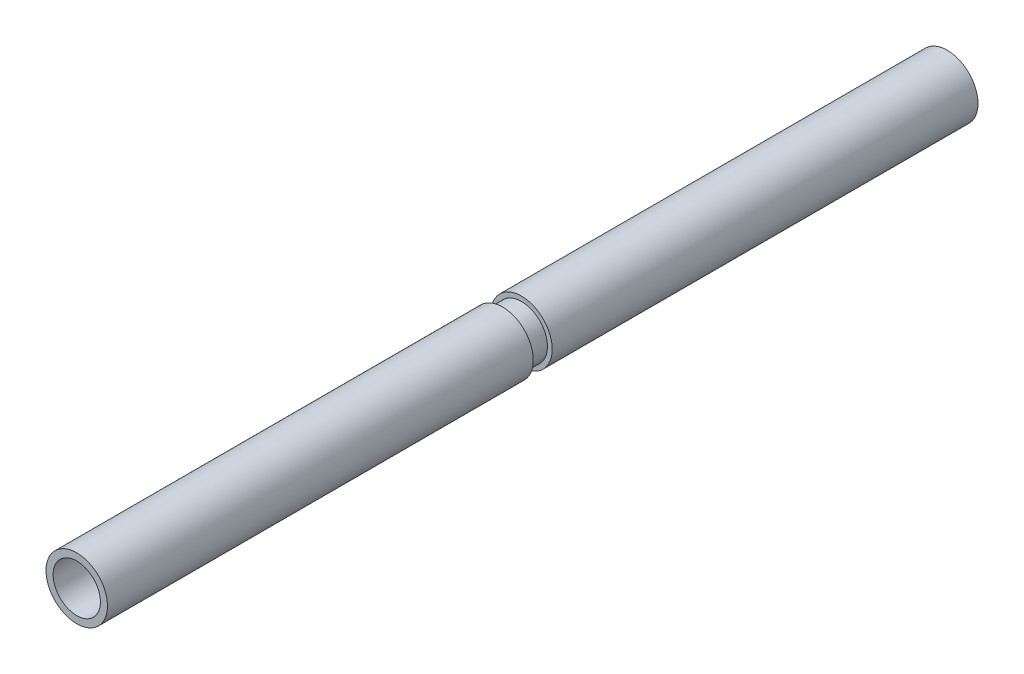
from build123d import *

# Parameters (mm, degrees)
SKETCH1_R           = 6.5
BOSS_EXTRUDE1_DEPTH = 90
SKETCH2_R           = 5.5
BOSS_EXTRUDE2_DEPTH = 4
BOSS_EXTRUDE3_START = 90
SKETCH3_R           = 6.5
BOSS_EXTRUDE3_DEPTH = 90
SKETCH5_R           = 5
CUT_EXTRUDE1_DEPTH  = 90
CUT_EXTRUDE2_START  = -90
SKETCH6_R           = 5
CUT_EXTRUDE2_DEPTH  = 90
SKETCH7_R           = 5
CUT_EXTRUDE3_DEPTH  = 90


with BuildPart() as part:
    # Sketch1 → Boss-Extrude1 (new body)
    with BuildSketch(Plane.XY):
        with Locations(Location((0, 0, 0), (0, 0, 180))):
            Circle(SKETCH1_R)
    extrude(amount=BOSS_EXTRUDE1_DEPTH)

    # Sketch2 → Boss-Extrude2 (add)
    with BuildSketch(Plane(origin=(0, 0, 0), x_dir=(-1, 0, 0), z_dir=(0, 0, -1))):
        Circle(SKETCH2_R)
    extrude(amount=BOSS_EXTRUDE2_DEPTH)

    # Sketch3 → Boss-Extrude3 (add)
    with BuildSketch(Plane(origin=(0, 0, -4), x_dir=(-1, 0, 0), z_dir=(0, 0, -1)).offset(BOSS_EXTRUDE3_START)):
        Circle(SKETCH3_R)
    extrude(amount=-BOSS_EXTRUDE3_DEPTH)

    # Sketch5 → Cut-Extrude1 (cut)
    with BuildSketch(Plane(origin=(0, 0, -94), x_dir=(-1, 0, 0), z_dir=(0, 0, -1))):
        Circle(SKETCH5_R)
    extrude(amount=-CUT_EXTRUDE1_DEPTH, mode=Mode.SUBTRACT)

    # Sketch6 → Cut-Extrude2 (cut)
    with BuildSketch(Plane.XY.offset(90).offset(CUT_EXTRUDE2_START)):
        with Locations(Location((0, 0, 0), (0, 0, 180))):
            Circle(SKETCH6_R)
    extrude(amount=CUT_EXTRUDE2_DEPTH, mode=Mode.SUBTRACT)

    # Sketch7 → Cut-Extrude3 (cut)
    with BuildSketch(Plane(origin=(0, 0, -4), x_dir=(-1, 0, 0), z_dir=(0, 0, -1))):
        Circle(SKETCH7_R)
    extrude(amount=-CUT_EXTRUDE3_DEPTH, mode=Mode.SUBTRACT)


solid = part.part
